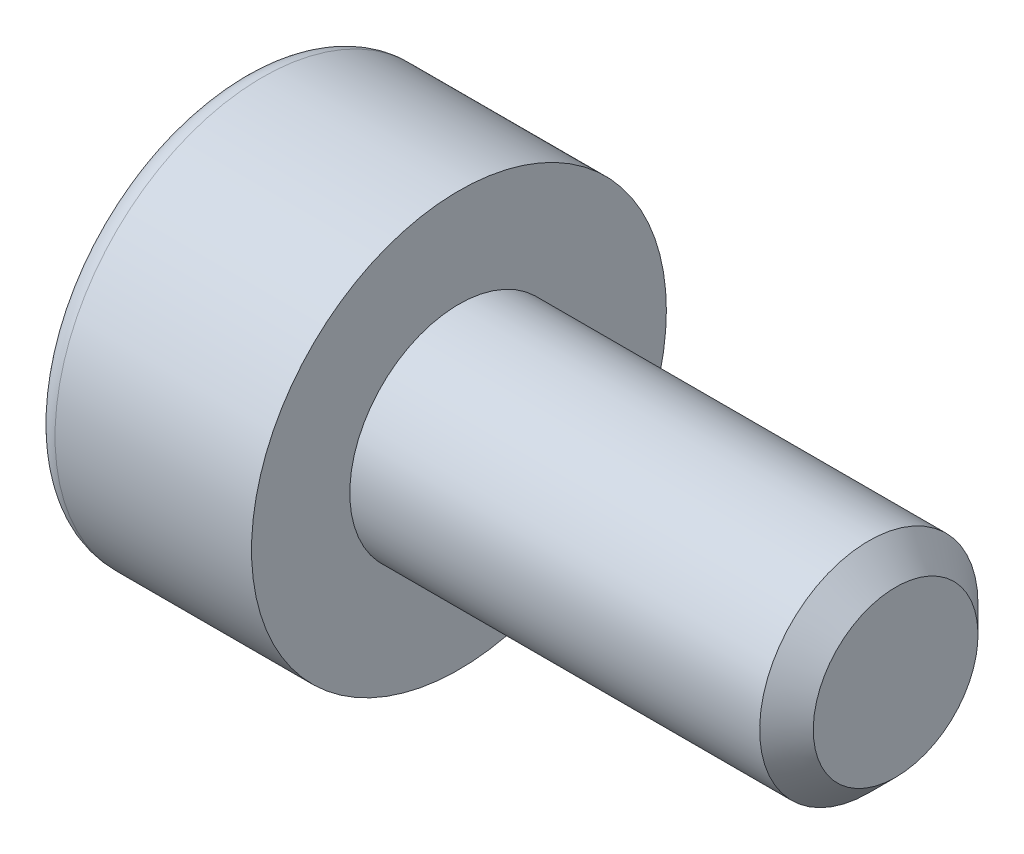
ISO-10303-21;
HEADER;
FILE_DESCRIPTION(('STEP AP214'),'2;1');
FILE_NAME('part.step','',(''),(''),'','','');
FILE_SCHEMA(('AUTOMOTIVE_DESIGN { 1 0 10303 214 1 1 1 1 }'));
ENDSEC;
DATA;
#1=APPLICATION_CONTEXT('core data for automotive mechanical design processes');
#2=APPLICATION_PROTOCOL_DEFINITION('international standard','automotive_design',2000,#1);
#3=PRODUCT_CONTEXT('',#1,'mechanical');
#4=PRODUCT('Part','Part','',(#3));
#5=PRODUCT_RELATED_PRODUCT_CATEGORY('part','',(#4));
#6=PRODUCT_DEFINITION_FORMATION('','',#4);
#7=PRODUCT_DEFINITION_CONTEXT('part definition',#1,'design');
#8=PRODUCT_DEFINITION('design','',#6,#7);
#9=PRODUCT_DEFINITION_SHAPE('','',#8);
#10=(LENGTH_UNIT() NAMED_UNIT(*) SI_UNIT(.MILLI.,.METRE.));
#11=(NAMED_UNIT(*) PLANE_ANGLE_UNIT() SI_UNIT($,.RADIAN.));
#12=(NAMED_UNIT(*) SI_UNIT($,.STERADIAN.) SOLID_ANGLE_UNIT());
#13=UNCERTAINTY_MEASURE_WITH_UNIT(LENGTH_MEASURE(1.E-05),#10,'distance_accuracy_value','');
#14=(GEOMETRIC_REPRESENTATION_CONTEXT(3) GLOBAL_UNCERTAINTY_ASSIGNED_CONTEXT((#13)) GLOBAL_UNIT_ASSIGNED_CONTEXT((#10,
#11,#12)) REPRESENTATION_CONTEXT('',''));
#15=CARTESIAN_POINT('',(0.,0.,0.));
#16=DIRECTION('',(0.,0.,1.));
#17=DIRECTION('',(1.,0.,0.));
#18=AXIS2_PLACEMENT_3D('',#15,#16,#17);
#19=CARTESIAN_POINT('',(-0.549999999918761,0.,0.));
#20=DIRECTION('',(-1.,0.,0.));
#21=DIRECTION('',(0.,0.,1.));
#22=AXIS2_PLACEMENT_3D('',#19,#20,#21);
#23=CONICAL_SURFACE('',#22,0.714285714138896,1.04719755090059);
#24=CARTESIAN_POINT('',(-0.137606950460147,0.,-2.8421709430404E-11));
#25=VERTEX_POINT('',#24);
#26=VERTEX_LOOP('',#25);
#27=FACE_BOUND('',#26,.T.);
#28=CARTESIAN_POINT('',(-0.5499999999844,0.,0.));
#29=DIRECTION('',(-1.,0.,0.));
#30=DIRECTION('',(0.,0.,1.));
#31=AXIS2_PLACEMENT_3D('',#28,#29,#30);
#32=CIRCLE('',#31,0.714285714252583);
#33=CARTESIAN_POINT('',(-0.5499999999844,0.,0.714285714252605));
#34=VERTEX_POINT('',#33);
#35=EDGE_CURVE('E175',#34,#34,#32,.T.);
#36=ORIENTED_EDGE('',*,*,#35,.T.);
#37=EDGE_LOOP('',(#36));
#38=FACE_BOUND('',#37,.T.);
#39=ADVANCED_FACE('F17',(#27,#38),#23,.F.);
#40=CARTESIAN_POINT('',(-0.549999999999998,0.430125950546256,0.745000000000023));
#41=DIRECTION('',(0.,0.,1.));
#42=DIRECTION('',(1.,0.,0.));
#43=AXIS2_PLACEMENT_3D('',#40,#41,#42);
#44=PLANE('',#43);
#45=DIRECTION('',(0.,1.00000000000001,0.));
#46=VECTOR('',#45,1.);
#47=CARTESIAN_POINT('',(-0.550000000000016,0.,0.74500000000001));
#48=LINE('',#47,#46);
#49=CARTESIAN_POINT('',(-0.549999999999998,0.430125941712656,0.745000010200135));
#50=VERTEX_POINT('',#49);
#51=CARTESIAN_POINT('',(-0.549999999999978,-0.430125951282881,0.744999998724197));
#52=VERTEX_POINT('',#51);
#53=EDGE_CURVE('E79',#50,#52,#48,.F.);
#54=ORIENTED_EDGE('',*,*,#53,.T.);
#55=DIRECTION('',(1.,0.,0.));
#56=VECTOR('',#55,1.);
#57=CARTESIAN_POINT('',(-0.549999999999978,-0.430125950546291,0.745000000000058));
#58=LINE('',#57,#56);
#59=CARTESIAN_POINT('',(-1.99525190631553,-0.430125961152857,0.744999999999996));
#60=VERTEX_POINT('',#59);
#61=EDGE_CURVE('E77',#52,#60,#58,.F.);
#62=ORIENTED_EDGE('',*,*,#61,.T.);
#63=CARTESIAN_POINT('',(-1.99525188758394,0.430125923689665,0.744999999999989));
#64=CARTESIAN_POINT('',(-1.98057857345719,0.400751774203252,0.745000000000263));
#65=CARTESIAN_POINT('',(-1.96676197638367,0.370889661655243,0.745000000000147));
#66=CARTESIAN_POINT('',(-1.94143587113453,0.309986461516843,0.744999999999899));
#67=CARTESIAN_POINT('',(-1.92994172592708,0.278939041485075,0.744999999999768));
#68=CARTESIAN_POINT('',(-1.91009392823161,0.2159467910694,0.745000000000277));
#69=CARTESIAN_POINT('',(-1.90172964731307,0.184005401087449,0.745000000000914));
#70=CARTESIAN_POINT('',(-1.88885202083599,0.119422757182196,0.744999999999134));
#71=CARTESIAN_POINT('',(-1.8843267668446,0.086783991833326,0.744999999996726));
#72=CARTESIAN_POINT('',(-1.88130477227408,0.0450212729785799,0.745000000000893));
#73=CARTESIAN_POINT('',(-1.88081631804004,0.0360213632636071,0.745000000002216));
#74=CARTESIAN_POINT('',(-1.88016321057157,0.0180152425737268,0.744999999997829));
#75=CARTESIAN_POINT('',(-1.8799983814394,0.00900903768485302,0.744999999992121));
#76=CARTESIAN_POINT('',(-1.88000811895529,-0.0451932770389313,0.74499999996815));
#77=CARTESIAN_POINT('',(-1.88420483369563,-0.0904578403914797,0.744999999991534));
#78=CARTESIAN_POINT('',(-1.90010453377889,-0.17978862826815,0.745000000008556));
#79=CARTESIAN_POINT('',(-1.91184842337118,-0.223846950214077,0.745000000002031));
#80=CARTESIAN_POINT('',(-1.93586010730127,-0.295054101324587,0.744999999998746));
#81=CARTESIAN_POINT('',(-1.94653452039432,-0.322769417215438,0.744999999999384));
#82=CARTESIAN_POINT('',(-1.96966958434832,-0.377150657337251,0.745000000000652));
#83=CARTESIAN_POINT('',(-1.9821130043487,-0.403823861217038,0.745000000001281));
#84=CARTESIAN_POINT('',(-1.99525191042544,-0.430125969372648,0.745000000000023));
#85=B_SPLINE_CURVE_WITH_KNOTS('',3,(#63,#64,#65,#66,#67,#68,#69,#70,#71,#72,#73,#74,#75,#76,#77,
#78,#79,#80,#81,#82,#83,#84),.UNSPECIFIED.,.F.,.F.,(4,2,2,2,2,2,2,2,2,2,4),(0.,
0.0985733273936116,0.197778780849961,0.296644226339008,0.395201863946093,0.422236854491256,
0.449257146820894,0.584802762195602,0.721089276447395,0.810123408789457,0.898343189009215),.UNSPECIFIED.);
#86=CARTESIAN_POINT('',(-1.99525189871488,0.430125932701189,0.745000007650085));
#87=VERTEX_POINT('',#86);
#88=EDGE_CURVE('E22',#87,#60,#85,.T.);
#89=ORIENTED_EDGE('',*,*,#88,.F.);
#90=DIRECTION('',(1.,0.,0.));
#91=VECTOR('',#90,1.);
#92=CARTESIAN_POINT('',(-0.549999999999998,0.430125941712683,0.745000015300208));
#93=LINE('',#92,#91);
#94=EDGE_CURVE('E74',#87,#50,#93,.T.);
#95=ORIENTED_EDGE('',*,*,#94,.T.);
#96=EDGE_LOOP('',(#54,#62,#89,#95));
#97=FACE_BOUND('',#96,.T.);
#98=ADVANCED_FACE('F72',(#97),#44,.F.);
#99=CARTESIAN_POINT('',(-0.549999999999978,0.,0.));
#100=DIRECTION('',(1.,0.,0.));
#101=DIRECTION('',(0.,0.,-1.));
#102=AXIS2_PLACEMENT_3D('',#99,#100,#101);
#103=PLANE('',#102);
#104=ORIENTED_EDGE('',*,*,#35,.F.);
#105=EDGE_LOOP('',(#104));
#106=FACE_BOUND('',#105,.T.);
#107=DIRECTION('',(0.,0.5,0.866025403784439));
#108=VECTOR('',#107,1.);
#109=CARTESIAN_POINT('',(-0.549999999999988,0.430125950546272,-0.744999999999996));
#110=LINE('',#109,#108);
#111=CARTESIAN_POINT('',(-0.549999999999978,0.860251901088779,-6.46011022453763E-12));
#112=VERTEX_POINT('',#111);
#113=CARTESIAN_POINT('',(-0.549999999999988,0.430125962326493,-0.744999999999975));
#114=VERTEX_POINT('',#113);
#115=EDGE_CURVE('E182',#112,#114,#110,.F.);
#116=ORIENTED_EDGE('',*,*,#115,.T.);
#117=DIRECTION('',(0.,1.00000000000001,0.));
#118=VECTOR('',#117,1.);
#119=CARTESIAN_POINT('',(-0.549999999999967,-0.430125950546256,-0.744999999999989));
#120=LINE('',#119,#118);
#121=CARTESIAN_POINT('',(-0.549999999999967,-0.430125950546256,-0.744999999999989));
#122=VERTEX_POINT('',#121);
#123=EDGE_CURVE('E188',#114,#122,#120,.F.);
#124=ORIENTED_EDGE('',*,*,#123,.T.);
#125=DIRECTION('',(0.,0.500000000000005,-0.866025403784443));
#126=VECTOR('',#125,1.);
#127=CARTESIAN_POINT('',(-0.549999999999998,-0.860251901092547,0.));
#128=LINE('',#127,#126);
#129=CARTESIAN_POINT('',(-0.549999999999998,-0.860251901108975,-2.83661982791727E-11));
#130=VERTEX_POINT('',#129);
#131=EDGE_CURVE('E194',#122,#130,#128,.F.);
#132=ORIENTED_EDGE('',*,*,#131,.T.);
#133=DIRECTION('',(0.,-0.5,-0.866025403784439));
#134=VECTOR('',#133,1.);
#135=CARTESIAN_POINT('',(-0.549999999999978,-0.430125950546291,0.745000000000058));
#136=LINE('',#135,#134);
#137=EDGE_CURVE('E168',#130,#52,#136,.F.);
#138=ORIENTED_EDGE('',*,*,#137,.T.);
#139=ORIENTED_EDGE('',*,*,#53,.F.);
#140=DIRECTION('',(0.,-0.500000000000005,0.866025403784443));
#141=VECTOR('',#140,1.);
#142=CARTESIAN_POINT('',(-0.549999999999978,0.860251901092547,0.));
#143=LINE('',#142,#141);
#144=EDGE_CURVE('E87',#50,#112,#143,.F.);
#145=ORIENTED_EDGE('',*,*,#144,.T.);
#146=EDGE_LOOP('',(#116,#124,#132,#138,#139,#145));
#147=FACE_BOUND('',#146,.T.);
#148=ADVANCED_FACE('F232',(#106,#147),#103,.F.);
#149=CARTESIAN_POINT('',(-0.549999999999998,-0.860251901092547,0.));
#150=DIRECTION('',(0.,-0.866025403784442,-0.499999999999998));
#151=DIRECTION('',(0.,0.500000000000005,-0.866025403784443));
#152=AXIS2_PLACEMENT_3D('',#149,#150,#151);
#153=PLANE('',#152);
#154=ORIENTED_EDGE('',*,*,#131,.F.);
#155=DIRECTION('',(-1.,0.,0.));
#156=VECTOR('',#155,1.);
#157=CARTESIAN_POINT('',(-0.549999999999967,-0.430125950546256,-0.744999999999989));
#158=LINE('',#157,#156);
#159=CARTESIAN_POINT('',(-1.99525189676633,-0.430125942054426,-0.745000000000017));
#160=VERTEX_POINT('',#159);
#161=EDGE_CURVE('E191',#122,#160,#158,.T.);
#162=ORIENTED_EDGE('',*,*,#161,.T.);
#163=CARTESIAN_POINT('',(-1.99525187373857,-0.430125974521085,-0.744999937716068));
#164=CARTESIAN_POINT('',(-1.9804824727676,-0.444909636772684,-0.719393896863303));
#165=CARTESIAN_POINT('',(-1.96658057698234,-0.459940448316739,-0.69335977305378));
#166=CARTESIAN_POINT('',(-1.941126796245,-0.490589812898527,-0.640273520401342));
#167=CARTESIAN_POINT('',(-1.92958906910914,-0.506211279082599,-0.613216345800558));
#168=CARTESIAN_POINT('',(-1.90982500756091,-0.537711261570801,-0.558656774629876));
#169=CARTESIAN_POINT('',(-1.90154900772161,-0.553581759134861,-0.531168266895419));
#170=CARTESIAN_POINT('',(-1.88879772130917,-0.585671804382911,-0.475586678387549));
#171=CARTESIAN_POINT('',(-1.88431292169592,-0.601890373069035,-0.447495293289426));
#172=CARTESIAN_POINT('',(-1.88026776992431,-0.629845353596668,-0.399075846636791));
#173=CARTESIAN_POINT('',(-1.87967004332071,-0.641545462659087,-0.37881066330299));
#174=CARTESIAN_POINT('',(-1.88067744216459,-0.664922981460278,-0.338319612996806));
#175=CARTESIAN_POINT('',(-1.88228305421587,-0.67660038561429,-0.318093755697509));
#176=CARTESIAN_POINT('',(-1.89029877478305,-0.711465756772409,-0.257705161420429));
#177=CARTESIAN_POINT('',(-1.89990867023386,-0.734480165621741,-0.217843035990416));
#178=CARTESIAN_POINT('',(-1.92308946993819,-0.774855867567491,-0.147910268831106));
#179=CARTESIAN_POINT('',(-1.93544104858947,-0.792407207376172,-0.117510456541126));
#180=CARTESIAN_POINT('',(-1.96326253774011,-0.826823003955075,-0.0579005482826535));
#181=CARTESIAN_POINT('',(-1.97872229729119,-0.843689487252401,-0.0286869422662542));
#182=CARTESIAN_POINT('',(-1.99525186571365,-0.860251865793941,-6.11390174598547E-08));
#183=B_SPLINE_CURVE_WITH_KNOTS('',3,(#163,#164,#165,#166,#167,#168,#169,#170,#171,#172,#173,
#174,#175,#176,#177,#178,#179,#180,#181,#182),.UNSPECIFIED.,.F.,.F.,(4,2,2,2,2,2,2,2,2,4),(0.,
0.0992212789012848,0.19902041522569,0.297235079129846,0.395202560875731,0.465324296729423,
0.535461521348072,0.675775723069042,0.78726404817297,0.898394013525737),.UNSPECIFIED.);
#184=CARTESIAN_POINT('',(-1.99525188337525,-0.86025188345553,-3.05907521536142E-08));
#185=VERTEX_POINT('',#184);
#186=EDGE_CURVE('E98',#160,#185,#183,.T.);
#187=ORIENTED_EDGE('',*,*,#186,.T.);
#188=DIRECTION('',(1.,0.,0.));
#189=VECTOR('',#188,1.);
#190=CARTESIAN_POINT('',(-0.549999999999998,-0.860251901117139,-4.25492974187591E-11));
#191=LINE('',#190,#189);
#192=EDGE_CURVE('E171',#185,#130,#191,.T.);
#193=ORIENTED_EDGE('',*,*,#192,.T.);
#194=EDGE_LOOP('',(#154,#162,#187,#193));
#195=FACE_BOUND('',#194,.T.);
#196=ADVANCED_FACE('F223',(#195),#153,.F.);
#197=CARTESIAN_POINT('',(-0.549999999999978,-0.430125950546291,0.745000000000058));
#198=DIRECTION('',(0.,-0.866025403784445,0.500000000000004));
#199=DIRECTION('',(0.,-0.5,-0.866025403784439));
#200=AXIS2_PLACEMENT_3D('',#197,#198,#199);
#201=PLANE('',#200);
#202=ORIENTED_EDGE('',*,*,#137,.F.);
#203=ORIENTED_EDGE('',*,*,#192,.F.);
#204=CARTESIAN_POINT('',(-1.99525190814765,-0.860251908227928,-1.23588639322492E-08));
#205=CARTESIAN_POINT('',(-1.9804825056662,-0.845468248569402,0.0256060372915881));
#206=CARTESIAN_POINT('',(-1.96658060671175,-0.830437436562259,0.0516401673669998));
#207=CARTESIAN_POINT('',(-1.94112681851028,-0.799788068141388,0.104726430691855));
#208=CARTESIAN_POINT('',(-1.92958908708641,-0.784166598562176,0.131783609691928));
#209=CARTESIAN_POINT('',(-1.90982501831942,-0.752666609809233,0.186343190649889));
#210=CARTESIAN_POINT('',(-1.90154901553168,-0.736796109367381,0.21383170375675));
#211=CARTESIAN_POINT('',(-1.88879772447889,-0.704706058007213,0.269413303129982));
#212=CARTESIAN_POINT('',(-1.88431292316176,-0.688487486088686,0.297504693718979));
#213=CARTESIAN_POINT('',(-1.88026777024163,-0.660532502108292,0.345924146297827));
#214=CARTESIAN_POINT('',(-1.87967004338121,-0.648832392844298,0.366189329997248));
#215=CARTESIAN_POINT('',(-1.88067744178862,-0.625454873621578,0.406680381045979));
#216=CARTESIAN_POINT('',(-1.88228305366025,-0.613777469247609,0.426906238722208));
#217=CARTESIAN_POINT('',(-1.89029877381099,-0.57891209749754,0.487294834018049));
#218=CARTESIAN_POINT('',(-1.89990866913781,-0.555897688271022,0.5271569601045));
#219=CARTESIAN_POINT('',(-1.92308946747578,-0.515521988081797,0.597089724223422));
#220=CARTESIAN_POINT('',(-1.93544104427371,-0.497970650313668,0.627489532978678));
#221=CARTESIAN_POINT('',(-1.96326252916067,-0.463554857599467,0.687099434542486));
#222=CARTESIAN_POINT('',(-1.97872228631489,-0.446688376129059,0.716313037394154));
#223=CARTESIAN_POINT('',(-1.99525185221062,-0.430125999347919,0.744999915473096));
#224=B_SPLINE_CURVE_WITH_KNOTS('',3,(#204,#205,#206,#207,#208,#209,#210,#211,#212,#213,#214,
#215,#216,#217,#218,#219,#220,#221,#222,#223),.UNSPECIFIED.,.F.,.F.,(4,2,2,2,2,2,2,2,2,4),(0.,
0.0992212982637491,0.199020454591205,0.297235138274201,0.395202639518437,0.465324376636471,
0.5354616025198,0.67577580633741,0.787264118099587,0.898394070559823),.UNSPECIFIED.);
#225=EDGE_CURVE('E94',#185,#60,#224,.T.);
#226=ORIENTED_EDGE('',*,*,#225,.T.);
#227=ORIENTED_EDGE('',*,*,#61,.F.);
#228=EDGE_LOOP('',(#202,#203,#226,#227));
#229=FACE_BOUND('',#228,.T.);
#230=ADVANCED_FACE('F230',(#229),#201,.F.);
#231=CARTESIAN_POINT('',(-0.549999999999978,0.860251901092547,0.));
#232=DIRECTION('',(0.,0.866025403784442,0.499999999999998));
#233=DIRECTION('',(0.,-0.500000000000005,0.866025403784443));
#234=AXIS2_PLACEMENT_3D('',#231,#232,#233);
#235=PLANE('',#234);
#236=ORIENTED_EDGE('',*,*,#144,.F.);
#237=ORIENTED_EDGE('',*,*,#94,.F.);
#238=CARTESIAN_POINT('',(-1.99525190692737,0.43012594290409,0.745000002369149));
#239=CARTESIAN_POINT('',(-1.98048250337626,0.444909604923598,0.719393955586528));
#240=CARTESIAN_POINT('',(-1.96658060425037,0.459940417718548,0.693359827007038));
#241=CARTESIAN_POINT('',(-1.94112681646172,0.490589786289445,0.640273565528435));
#242=CARTESIAN_POINT('',(-1.92958908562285,0.50621125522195,0.613216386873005));
#243=CARTESIAN_POINT('',(-1.90982501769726,0.537711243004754,0.558656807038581));
#244=CARTESIAN_POINT('',(-1.90154901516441,0.553581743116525,0.53116829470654));
#245=CARTESIAN_POINT('',(-1.88879772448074,0.585671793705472,0.475586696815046));
#246=CARTESIAN_POINT('',(-1.8843129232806,0.601890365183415,0.447495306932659));
#247=CARTESIAN_POINT('',(-1.88026777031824,0.629845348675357,0.39907585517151));
#248=CARTESIAN_POINT('',(-1.87967004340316,0.641545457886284,0.37881067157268));
#249=CARTESIAN_POINT('',(-1.88067744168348,0.664922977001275,0.338319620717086));
#250=CARTESIAN_POINT('',(-1.88228305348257,0.676600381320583,0.3180937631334));
#251=CARTESIAN_POINT('',(-1.89029877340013,0.711465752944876,0.257705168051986));
#252=CARTESIAN_POINT('',(-1.89990866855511,0.734480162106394,0.217843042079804));
#253=CARTESIAN_POINT('',(-1.92308946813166,0.774855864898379,0.147910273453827));
#254=CARTESIAN_POINT('',(-1.93544104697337,0.792407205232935,0.11751046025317));
#255=CARTESIAN_POINT('',(-1.96326253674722,0.826823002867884,0.0579005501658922));
#256=CARTESIAN_POINT('',(-1.97872229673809,0.843689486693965,0.0286869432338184));
#257=CARTESIAN_POINT('',(-1.99525186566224,0.860251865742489,6.1228036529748E-08));
#258=B_SPLINE_CURVE_WITH_KNOTS('',3,(#238,#239,#240,#241,#242,#243,#244,#245,#246,#247,#248,
#249,#250,#251,#252,#253,#254,#255,#256,#257),.UNSPECIFIED.,.F.,.F.,(4,2,2,2,2,2,2,2,2,4),(0.,
0.0992212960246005,0.199020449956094,0.297235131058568,0.395202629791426,0.465324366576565,
0.53546159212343,0.675775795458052,0.78726412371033,0.898394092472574),.UNSPECIFIED.);
#259=CARTESIAN_POINT('',(-1.99525188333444,0.860251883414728,3.06091610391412E-08));
#260=VERTEX_POINT('',#259);
#261=EDGE_CURVE('E84',#87,#260,#258,.T.);
#262=ORIENTED_EDGE('',*,*,#261,.T.);
#263=DIRECTION('',(1.,0.,0.));
#264=VECTOR('',#263,1.);
#265=CARTESIAN_POINT('',(-0.549999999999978,0.860251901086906,-9.67975699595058E-12));
#266=LINE('',#265,#264);
#267=EDGE_CURVE('E179',#260,#112,#266,.T.);
#268=ORIENTED_EDGE('',*,*,#267,.T.);
#269=EDGE_LOOP('',(#236,#237,#262,#268));
#270=FACE_BOUND('',#269,.T.);
#271=ADVANCED_FACE('F82',(#270),#235,.F.);
#272=CARTESIAN_POINT('',(-0.549999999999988,0.430125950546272,-0.744999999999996));
#273=DIRECTION('',(0.,0.866025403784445,-0.500000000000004));
#274=DIRECTION('',(0.,0.5,0.866025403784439));
#275=AXIS2_PLACEMENT_3D('',#272,#273,#274);
#276=PLANE('',#275);
#277=ORIENTED_EDGE('',*,*,#115,.F.);
#278=ORIENTED_EDGE('',*,*,#267,.F.);
#279=CARTESIAN_POINT('',(-1.99525190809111,0.86025190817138,1.22609006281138E-08));
#280=CARTESIAN_POINT('',(-1.98048250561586,0.84546824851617,-0.025606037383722));
#281=CARTESIAN_POINT('',(-1.96658060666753,0.830437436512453,-0.0516401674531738));
#282=CARTESIAN_POINT('',(-1.94112681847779,0.799788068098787,-0.104726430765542));
#283=CARTESIAN_POINT('',(-1.92958908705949,0.784166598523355,-0.131783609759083));
#284=CARTESIAN_POINT('',(-1.90982501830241,0.752666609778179,-0.186343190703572));
#285=CARTESIAN_POINT('',(-1.90154901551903,0.736796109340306,-0.213831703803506));
#286=CARTESIAN_POINT('',(-1.88879772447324,0.704706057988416,-0.269413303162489));
#287=CARTESIAN_POINT('',(-1.88431292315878,0.688487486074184,-0.297504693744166));
#288=CARTESIAN_POINT('',(-1.88026777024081,0.66053250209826,-0.345924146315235));
#289=CARTESIAN_POINT('',(-1.87967004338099,0.648832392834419,-0.366189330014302));
#290=CARTESIAN_POINT('',(-1.88067744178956,0.625454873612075,-0.406680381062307));
#291=CARTESIAN_POINT('',(-1.88228305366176,0.613777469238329,-0.426906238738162));
#292=CARTESIAN_POINT('',(-1.89029877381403,0.57891209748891,-0.48729483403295));
#293=CARTESIAN_POINT('',(-1.89990866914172,0.55589768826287,-0.527156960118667));
#294=CARTESIAN_POINT('',(-1.92308946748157,0.515521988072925,-0.597089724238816));
#295=CARTESIAN_POINT('',(-1.93544104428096,0.497970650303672,-0.627489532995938));
#296=CARTESIAN_POINT('',(-1.96326252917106,0.463554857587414,-0.687099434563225));
#297=CARTESIAN_POINT('',(-1.97872228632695,0.446688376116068,-0.716313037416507));
#298=CARTESIAN_POINT('',(-1.99525185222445,0.430125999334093,-0.744999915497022));
#299=B_SPLINE_CURVE_WITH_KNOTS('',3,(#279,#280,#281,#282,#283,#284,#285,#286,#287,#288,#289,
#290,#291,#292,#293,#294,#295,#296,#297,#298),.UNSPECIFIED.,.F.,.F.,(4,2,2,2,2,2,2,2,2,4),(0.,
0.09922129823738,0.19902045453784,0.297235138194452,0.395202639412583,0.465324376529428,
0.535461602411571,0.675775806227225,0.787264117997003,0.898394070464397),.UNSPECIFIED.);
#300=CARTESIAN_POINT('',(-1.99525188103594,0.430125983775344,-0.744999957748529));
#301=VERTEX_POINT('',#300);
#302=EDGE_CURVE('E93',#260,#301,#299,.T.);
#303=ORIENTED_EDGE('',*,*,#302,.T.);
#304=DIRECTION('',(-1.,0.,0.));
#305=VECTOR('',#304,1.);
#306=CARTESIAN_POINT('',(-0.549999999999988,0.430125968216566,-0.744999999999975));
#307=LINE('',#306,#305);
#308=EDGE_CURVE('E185',#301,#114,#307,.F.);
#309=ORIENTED_EDGE('',*,*,#308,.T.);
#310=EDGE_LOOP('',(#277,#278,#303,#309));
#311=FACE_BOUND('',#310,.T.);
#312=ADVANCED_FACE('F304',(#311),#276,.F.);
#313=CARTESIAN_POINT('',(-0.549999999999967,-0.430125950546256,-0.744999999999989));
#314=DIRECTION('',(0.,0.,-1.));
#315=DIRECTION('',(-1.,0.,0.));
#316=AXIS2_PLACEMENT_3D('',#313,#314,#315);
#317=PLANE('',#316);
#318=ORIENTED_EDGE('',*,*,#123,.F.);
#319=ORIENTED_EDGE('',*,*,#308,.F.);
#320=CARTESIAN_POINT('',(-1.99525192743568,0.430125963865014,-0.744999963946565));
#321=CARTESIAN_POINT('',(-1.98057860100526,0.400751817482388,-0.744999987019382));
#322=CARTESIAN_POINT('',(-1.96676199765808,0.370889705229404,-0.744999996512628));
#323=CARTESIAN_POINT('',(-1.94143588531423,0.309986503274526,-0.745000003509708));
#324=CARTESIAN_POINT('',(-1.92994173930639,0.278939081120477,-0.745000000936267));
#325=CARTESIAN_POINT('',(-1.91009393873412,0.215946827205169,-0.744999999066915));
#326=CARTESIAN_POINT('',(-1.90172965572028,0.184005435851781,-0.744999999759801));
#327=CARTESIAN_POINT('',(-1.88885202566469,0.119422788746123,-0.745000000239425));
#328=CARTESIAN_POINT('',(-1.88432677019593,0.0867840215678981,-0.745000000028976));
#329=CARTESIAN_POINT('',(-1.88130477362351,0.0450212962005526,-0.744999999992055));
#330=CARTESIAN_POINT('',(-1.88081631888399,0.0360213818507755,-0.744999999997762));
#331=CARTESIAN_POINT('',(-1.88016321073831,0.0180152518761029,-0.745000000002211));
#332=CARTESIAN_POINT('',(-1.87999838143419,0.00900904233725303,-0.745000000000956));
#333=CARTESIAN_POINT('',(-1.88000811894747,-0.0451932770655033,-0.744999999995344));
#334=CARTESIAN_POINT('',(-1.88420483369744,-0.0904578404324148,-0.744999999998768));
#335=CARTESIAN_POINT('',(-1.90010453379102,-0.179788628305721,-0.745000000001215));
#336=CARTESIAN_POINT('',(-1.91184842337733,-0.223846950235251,-0.745000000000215));
#337=CARTESIAN_POINT('',(-1.93586010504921,-0.295054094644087,-0.744999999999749));
#338=CARTESIAN_POINT('',(-1.94653451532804,-0.322769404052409,-0.744999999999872));
#339=CARTESIAN_POINT('',(-1.96966957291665,-0.377150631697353,-0.745000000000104));
#340=CARTESIAN_POINT('',(-1.98211298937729,-0.403823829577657,-0.745000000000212));
#341=CARTESIAN_POINT('',(-1.9952518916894,-0.430125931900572,-0.74500000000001));
#342=B_SPLINE_CURVE_WITH_KNOTS('',3,(#320,#321,#322,#323,#324,#325,#326,#327,#328,#329,#330,
#331,#332,#333,#334,#335,#336,#337,#338,#339,#340,#341),.UNSPECIFIED.,.F.,.F.,(4,2,2,2,2,2,2,2,
2,2,4),(0.,0.0985733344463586,0.197778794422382,0.29664424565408,0.395201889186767,
0.422236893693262,0.449257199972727,0.584802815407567,0.721089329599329,0.810123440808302,
0.8983432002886),.UNSPECIFIED.);
#343=EDGE_CURVE('E96',#301,#160,#342,.T.);
#344=ORIENTED_EDGE('',*,*,#343,.T.);
#345=ORIENTED_EDGE('',*,*,#161,.F.);
#346=EDGE_LOOP('',(#318,#319,#344,#345));
#347=FACE_BOUND('',#346,.T.);
#348=ADVANCED_FACE('F120',(#347),#317,.F.);
#349=CARTESIAN_POINT('',(-1.999999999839,0.,0.));
#350=DIRECTION('',(-1.,0.,0.));
#351=DIRECTION('',(0.,0.,1.));
#352=AXIS2_PLACEMENT_3D('',#349,#350,#351);
#353=CONICAL_SURFACE('',#352,0.864999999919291,0.785398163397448);
#354=ORIENTED_EDGE('',*,*,#261,.F.);
#355=ORIENTED_EDGE('',*,*,#88,.T.);
#356=ORIENTED_EDGE('',*,*,#225,.F.);
#357=ORIENTED_EDGE('',*,*,#186,.F.);
#358=ORIENTED_EDGE('',*,*,#343,.F.);
#359=ORIENTED_EDGE('',*,*,#302,.F.);
#360=EDGE_LOOP('',(#354,#355,#356,#357,#358,#359));
#361=FACE_BOUND('',#360,.T.);
#362=CARTESIAN_POINT('',(-1.99999999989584,0.,0.));
#363=DIRECTION('',(-1.,0.,0.));
#364=DIRECTION('',(0.,0.,1.));
#365=AXIS2_PLACEMENT_3D('',#362,#363,#364);
#366=CIRCLE('',#365,0.864999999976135);
#367=CARTESIAN_POINT('',(-1.99999999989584,0.,0.86499999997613));
#368=VERTEX_POINT('',#367);
#369=EDGE_CURVE('E136',#368,#368,#366,.F.);
#370=ORIENTED_EDGE('',*,*,#369,.F.);
#371=EDGE_LOOP('',(#370));
#372=FACE_BOUND('',#371,.T.);
#373=ADVANCED_FACE('F90',(#361,#372),#353,.F.);
#374=CARTESIAN_POINT('',(-2.,1.28250000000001,0.));
#375=DIRECTION('',(-1.,0.,0.));
#376=DIRECTION('',(0.,0.,1.));
#377=AXIS2_PLACEMENT_3D('',#374,#375,#376);
#378=PLANE('',#377);
#379=ORIENTED_EDGE('',*,*,#369,.T.);
#380=EDGE_LOOP('',(#379));
#381=FACE_BOUND('',#380,.T.);
#382=CARTESIAN_POINT('',(-1.99999999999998,1.70000000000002,0.));
#383=CARTESIAN_POINT('',(-1.99999997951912,1.70000245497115,0.0305664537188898));
#384=CARTESIAN_POINT('',(-1.99999999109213,1.69917412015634,0.0611268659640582));
#385=CARTESIAN_POINT('',(-2.00000000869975,1.69589489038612,0.12216007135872));
#386=CARTESIAN_POINT('',(-2.00000001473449,1.69344403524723,0.152632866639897));
#387=CARTESIAN_POINT('',(-1.99999994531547,1.68631037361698,0.219494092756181));
#388=CARTESIAN_POINT('',(-1.99999985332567,1.68127925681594,0.255846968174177));
#389=CARTESIAN_POINT('',(-1.99999981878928,1.67340820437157,0.301183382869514));
#390=CARTESIAN_POINT('',(-1.99999981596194,1.67172918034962,0.310375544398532));
#391=CARTESIAN_POINT('',(-1.99999981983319,1.66513061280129,0.344835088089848));
#392=CARTESIAN_POINT('',(-1.99999985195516,1.65969499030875,0.370004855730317));
#393=CARTESIAN_POINT('',(-1.99999992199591,1.64404231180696,0.435266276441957));
#394=CARTESIAN_POINT('',(-1.99999995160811,1.63292512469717,0.475146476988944));
#395=CARTESIAN_POINT('',(-1.9999999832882,1.614013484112,0.53449232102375));
#396=CARTESIAN_POINT('',(-1.99999999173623,1.60729198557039,0.554307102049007));
#397=CARTESIAN_POINT('',(-1.99999999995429,1.59355423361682,0.592488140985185));
#398=CARTESIAN_POINT('',(-2.00000000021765,1.58658030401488,0.610869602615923));
#399=CARTESIAN_POINT('',(-1.99999999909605,1.56715083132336,0.659552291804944));
#400=CARTESIAN_POINT('',(-1.99999999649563,1.55413951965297,0.68963340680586));
#401=CARTESIAN_POINT('',(-1.99999999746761,1.52642076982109,0.749003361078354));
#402=CARTESIAN_POINT('',(-2.00000000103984,1.51171338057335,0.778292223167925));
#403=CARTESIAN_POINT('',(-1.99999999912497,1.48841868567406,0.821557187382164));
#404=CARTESIAN_POINT('',(-1.99999999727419,1.4804477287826,0.835868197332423));
#405=CARTESIAN_POINT('',(-1.99999998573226,1.46410060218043,0.864257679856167));
#406=CARTESIAN_POINT('',(-1.99999997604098,1.45572442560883,0.87833614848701));
#407=CARTESIAN_POINT('',(-1.99999994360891,1.4368568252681,0.90903901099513));
#408=CARTESIAN_POINT('',(-1.9999999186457,1.42627742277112,0.9256093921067));
#409=CARTESIAN_POINT('',(-1.99999982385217,1.40456316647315,0.958383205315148));
#410=CARTESIAN_POINT('',(-1.99999975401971,1.3934282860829,0.974586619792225));
#411=CARTESIAN_POINT('',(-1.99999959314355,1.36664548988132,1.01210764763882));
#412=CARTESIAN_POINT('',(-1.99999950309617,1.35076618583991,1.03326051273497));
#413=CARTESIAN_POINT('',(-1.99999951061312,1.31390000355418,1.0799474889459));
#414=CARTESIAN_POINT('',(-1.99999966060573,1.29262744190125,1.10525758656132));
#415=CARTESIAN_POINT('',(-1.99999989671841,1.25734405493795,1.1446190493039));
#416=CARTESIAN_POINT('',(-1.99999998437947,1.24383374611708,1.15912281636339));
#417=CARTESIAN_POINT('',(-2.00000000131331,1.22689078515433,1.17677832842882));
#418=CARTESIAN_POINT('',(-2.00000000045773,1.2236579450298,1.18012369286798));
#419=CARTESIAN_POINT('',(-1.99999999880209,1.21296499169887,1.19111797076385));
#420=CARTESIAN_POINT('',(-1.99999999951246,1.20545898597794,1.19872249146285));
#421=CARTESIAN_POINT('',(-2.000000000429,1.1864692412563,1.21760476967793));
#422=CARTESIAN_POINT('',(-2.00000000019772,1.17489591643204,1.22879266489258));
#423=CARTESIAN_POINT('',(-1.99999999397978,1.14749877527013,1.25454690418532));
#424=CARTESIAN_POINT('',(-1.9999999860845,1.13155397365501,1.26898463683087));
#425=CARTESIAN_POINT('',(-1.9999999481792,1.0950506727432,1.30080550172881));
#426=CARTESIAN_POINT('',(-1.99999991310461,1.0743407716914,1.31801567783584));
#427=CARTESIAN_POINT('',(-1.99999983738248,1.0404446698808,1.34484655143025));
#428=CARTESIAN_POINT('',(-1.99999980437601,1.02750918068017,1.354785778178));
#429=CARTESIAN_POINT('',(-1.99999974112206,1.00135360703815,1.37428302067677));
#430=CARTESIAN_POINT('',(-1.99999971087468,0.98813351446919,1.38384102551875));
#431=CARTESIAN_POINT('',(-1.9999996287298,0.948064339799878,1.41193217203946));
#432=CARTESIAN_POINT('',(-1.99999958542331,0.920804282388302,1.42988409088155));
#433=CARTESIAN_POINT('',(-1.99999954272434,0.865287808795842,1.46417098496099));
#434=CARTESIAN_POINT('',(-1.99999954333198,0.837031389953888,1.48050595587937));
#435=CARTESIAN_POINT('',(-1.99999958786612,0.779616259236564,1.51150343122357));
#436=CARTESIAN_POINT('',(-1.99999963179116,0.750457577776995,1.5261659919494));
#437=CARTESIAN_POINT('',(-1.99999974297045,0.691340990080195,1.55377339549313));
#438=CARTESIAN_POINT('',(-1.99999981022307,0.661383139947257,1.56671835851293));
#439=CARTESIAN_POINT('',(-1.99999993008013,0.600760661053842,1.59082700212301));
#440=CARTESIAN_POINT('',(-1.99999998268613,0.570096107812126,1.60199087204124));
#441=CARTESIAN_POINT('',(-2.00000000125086,0.52714423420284,1.61627407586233));
#442=CARTESIAN_POINT('',(-2.00000000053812,0.515098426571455,1.62013437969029));
#443=CARTESIAN_POINT('',(-1.99999999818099,0.48411244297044,1.6296981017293));
#444=CARTESIAN_POINT('',(-1.99999999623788,0.465113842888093,1.63521373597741));
#445=CARTESIAN_POINT('',(-1.99999999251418,0.420053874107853,1.64745065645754));
#446=CARTESIAN_POINT('',(-1.99999999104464,0.393915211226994,1.65388986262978));
#447=CARTESIAN_POINT('',(-1.99999999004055,0.351892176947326,1.66319489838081));
#448=CARTESIAN_POINT('',(-1.99999998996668,0.336094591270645,1.66645886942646));
#449=CARTESIAN_POINT('',(-1.99999999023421,0.302661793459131,1.67287305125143));
#450=CARTESIAN_POINT('',(-1.99999999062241,0.285016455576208,1.67597081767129));
#451=CARTESIAN_POINT('',(-1.9999999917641,0.247876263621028,1.68188882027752));
#452=CARTESIAN_POINT('',(-1.99999999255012,0.228372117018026,1.68465075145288));
#453=CARTESIAN_POINT('',(-1.99999999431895,0.18751024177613,1.68971557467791));
#454=CARTESIAN_POINT('',(-1.99999999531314,0.166144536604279,1.69195428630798));
#455=CARTESIAN_POINT('',(-1.99999999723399,0.121567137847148,1.69577357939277));
#456=CARTESIAN_POINT('',(-1.9999999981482,0.0983494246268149,1.69728410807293));
#457=CARTESIAN_POINT('',(-1.99999999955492,0.0500901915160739,1.69943156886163));
#458=CARTESIAN_POINT('',(-2.00000000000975,0.0250452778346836,1.69999267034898));
#459=CARTESIAN_POINT('',(-1.99999999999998,0.,1.7));
#460=B_SPLINE_CURVE_WITH_KNOTS('',3,(#382,#383,#384,#385,#386,#387,#388,#389,#390,#391,#392,
#393,#394,#395,#396,#397,#398,#399,#400,#401,#402,#403,#404,#405,#406,#407,#408,#409,#410,#411,
#412,#413,#414,#415,#416,#417,#418,#419,#420,#421,#422,#423,#424,#425,#426,#427,#428,#429,#430,
#431,#432,#433,#434,#435,#436,#437,#438,#439,#440,#441,#442,#443,#444,#445,#446,#447,#448,#449,
#450,#451,#452,#453,#454,#455,#456,#457,#458,#459),.UNSPECIFIED.,.F.,.F.,(4,2,2,2,2,2,2,2,2,2,2,
2,2,2,2,2,2,2,2,2,2,2,2,2,2,2,2,2,2,2,2,2,2,2,2,2,2,2,4),(0.,0.0916770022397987,
0.183351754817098,0.29335810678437,0.321390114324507,0.398614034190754,0.522689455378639,
0.585449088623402,0.644418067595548,0.742686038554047,0.840951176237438,0.890088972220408,
0.939227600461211,0.99819489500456,1.05716501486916,1.1364850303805,1.23560005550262,
1.2950528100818,1.30900934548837,1.34106270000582,1.38934690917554,1.45386279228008,
1.53461196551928,1.58354479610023,1.6324790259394,1.73033954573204,1.82820032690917,
1.9260578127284,2.02390844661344,2.12174867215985,2.15969457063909,2.21903217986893,
2.29975894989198,2.34814723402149,2.40188357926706,2.46096801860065,2.52540061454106,
2.59518145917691,2.67031067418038),.UNSPECIFIED.);
#461=CARTESIAN_POINT('',(-1.99999999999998,1.7,0.));
#462=VERTEX_POINT('',#461);
#463=CARTESIAN_POINT('',(-2.00000000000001,0.,1.7));
#464=VERTEX_POINT('',#463);
#465=EDGE_CURVE('E150',#462,#464,#460,.T.);
#466=ORIENTED_EDGE('',*,*,#465,.F.);
#467=CARTESIAN_POINT('',(-1.99999999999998,0.,-1.70000000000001));
#468=CARTESIAN_POINT('',(-1.99999997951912,0.0305664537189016,-1.70000245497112));
#469=CARTESIAN_POINT('',(-1.99999999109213,0.0611268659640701,-1.69917412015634));
#470=CARTESIAN_POINT('',(-2.00000000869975,0.122160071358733,-1.69589489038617));
#471=CARTESIAN_POINT('',(-2.00000001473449,0.152632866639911,-1.69344403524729));
#472=CARTESIAN_POINT('',(-1.99999994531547,0.219494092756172,-1.68631037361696));
#473=CARTESIAN_POINT('',(-1.99999985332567,0.255846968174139,-1.68127925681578));
#474=CARTESIAN_POINT('',(-1.99999981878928,0.301183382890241,-1.673408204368));
#475=CARTESIAN_POINT('',(-1.99999981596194,0.310375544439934,-1.67172918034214));
#476=CARTESIAN_POINT('',(-1.99999981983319,0.34483508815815,-1.66513061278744));
#477=CARTESIAN_POINT('',(-1.99999985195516,0.370004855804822,-1.65969499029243));
#478=CARTESIAN_POINT('',(-1.99999992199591,0.435266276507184,-1.64404231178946));
#479=CARTESIAN_POINT('',(-1.99999995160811,0.475146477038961,-1.63292512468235));
#480=CARTESIAN_POINT('',(-1.9999999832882,0.534492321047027,-1.61401348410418));
#481=CARTESIAN_POINT('',(-1.99999999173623,0.554307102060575,-1.60729198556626));
#482=CARTESIAN_POINT('',(-1.99999999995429,0.592488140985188,-1.59355423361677));
#483=CARTESIAN_POINT('',(-2.00000000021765,0.610869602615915,-1.5865803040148));
#484=CARTESIAN_POINT('',(-1.99999999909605,0.659552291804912,-1.56715083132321));
#485=CARTESIAN_POINT('',(-1.99999999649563,0.689633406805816,-1.55413951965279));
#486=CARTESIAN_POINT('',(-1.99999999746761,0.749003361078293,-1.52642076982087));
#487=CARTESIAN_POINT('',(-2.00000000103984,0.77829222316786,-1.51171338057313));
#488=CARTESIAN_POINT('',(-1.99999999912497,0.821557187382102,-1.48841868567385));
#489=CARTESIAN_POINT('',(-1.99999999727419,0.835868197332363,-1.4804477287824));
#490=CARTESIAN_POINT('',(-1.99999998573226,0.864257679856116,-1.46410060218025));
#491=CARTESIAN_POINT('',(-1.99999997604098,0.878336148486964,-1.45572442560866));
#492=CARTESIAN_POINT('',(-1.99999994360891,0.909039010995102,-1.43685682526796));
#493=CARTESIAN_POINT('',(-1.9999999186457,0.925609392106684,-1.426277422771));
#494=CARTESIAN_POINT('',(-1.99999982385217,0.958383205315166,-1.40456316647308));
#495=CARTESIAN_POINT('',(-1.99999975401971,0.974586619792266,-1.39342828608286));
#496=CARTESIAN_POINT('',(-1.99999959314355,1.01210764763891,-1.36664548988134));
#497=CARTESIAN_POINT('',(-1.99999950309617,1.03326051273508,-1.35076618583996));
#498=CARTESIAN_POINT('',(-1.99999951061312,1.07994748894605,-1.31390000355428));
#499=CARTESIAN_POINT('',(-1.99999966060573,1.1052575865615,-1.29262744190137));
#500=CARTESIAN_POINT('',(-1.99999989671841,1.14461904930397,-1.25734405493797));
#501=CARTESIAN_POINT('',(-1.99999998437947,1.15912281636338,-1.24383374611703));
#502=CARTESIAN_POINT('',(-2.00000000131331,1.17677832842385,-1.22689078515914));
#503=CARTESIAN_POINT('',(-2.00000000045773,1.18012369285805,-1.22365794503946));
#504=CARTESIAN_POINT('',(-1.99999999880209,1.19111797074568,-1.21296499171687));
#505=CARTESIAN_POINT('',(-1.99999999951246,1.19872249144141,-1.20545898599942));
#506=CARTESIAN_POINT('',(-2.000000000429,1.21760476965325,-1.18646924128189));
#507=CARTESIAN_POINT('',(-2.00000000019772,1.2287926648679,-1.17489591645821));
#508=CARTESIAN_POINT('',(-1.99999999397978,1.25454690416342,-1.14749877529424));
#509=CARTESIAN_POINT('',(-1.9999999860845,1.26898463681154,-1.13155397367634));
#510=CARTESIAN_POINT('',(-1.9999999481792,1.30080550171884,-1.09505067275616));
#511=CARTESIAN_POINT('',(-1.99999991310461,1.31801567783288,-1.07434077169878));
#512=CARTESIAN_POINT('',(-1.99999983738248,1.34484655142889,-1.04044466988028));
#513=CARTESIAN_POINT('',(-1.99999980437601,1.35478577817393,-1.02750918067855));
#514=CARTESIAN_POINT('',(-1.99999974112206,1.3742830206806,-1.0013536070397));
#515=CARTESIAN_POINT('',(-1.99999971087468,1.38384102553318,-0.988133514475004));
#516=CARTESIAN_POINT('',(-1.99999962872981,1.41193217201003,-0.948064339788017));
#517=CARTESIAN_POINT('',(-1.99999958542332,1.42988409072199,-0.920804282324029));
#518=CARTESIAN_POINT('',(-1.99999954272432,1.46417098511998,-0.865287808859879));
#519=CARTESIAN_POINT('',(-1.99999954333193,1.48050595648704,-0.837031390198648));
#520=CARTESIAN_POINT('',(-1.99999958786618,1.51150343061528,-0.779616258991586));
#521=CARTESIAN_POINT('',(-1.99999963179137,1.52616598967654,-0.750457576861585));
#522=CARTESIAN_POINT('',(-1.99999974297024,1.55377339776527,-0.691340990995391));
#523=CARTESIAN_POINT('',(-1.99999981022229,1.56671836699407,-0.66138314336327));
#524=CARTESIAN_POINT('',(-1.9999999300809,1.59082699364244,-0.600760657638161));
#525=CARTESIAN_POINT('',(-1.99999998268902,1.60199084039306,-0.570096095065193));
#526=CARTESIAN_POINT('',(-2.00000000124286,1.61626879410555,-0.527160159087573));
#527=CARTESIAN_POINT('',(-2.00000000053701,1.62012417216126,-0.515130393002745));
#528=CARTESIAN_POINT('',(-1.99999999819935,1.62968092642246,-0.484170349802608));
#529=CARTESIAN_POINT('',(-1.99999999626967,1.63519450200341,-0.465181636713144));
#530=CARTESIAN_POINT('',(-1.99999999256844,1.64743006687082,-0.42013520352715));
#531=CARTESIAN_POINT('',(-1.99999999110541,1.65386979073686,-0.394000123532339));
#532=CARTESIAN_POINT('',(-1.9999999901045,1.66317652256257,-0.351980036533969));
#533=CARTESIAN_POINT('',(-1.99999999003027,1.66644149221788,-0.336181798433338));
#534=CARTESIAN_POINT('',(-1.99999999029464,1.67285803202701,-0.302746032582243));
#535=CARTESIAN_POINT('',(-1.99999999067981,1.67595710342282,-0.285098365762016));
#536=CARTESIAN_POINT('',(-1.99999999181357,1.68187790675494,-0.247951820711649));
#537=CARTESIAN_POINT('',(-1.99999999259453,1.68464126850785,-0.228443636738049));
#538=CARTESIAN_POINT('',(-1.99999999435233,1.68970893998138,-0.187571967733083));
#539=CARTESIAN_POINT('',(-1.99999999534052,1.69194899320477,-0.166200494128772));
#540=CARTESIAN_POINT('',(-1.99999999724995,1.69577071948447,-0.121609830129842));
#541=CARTESIAN_POINT('',(-1.99999999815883,1.6972822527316,-0.0983846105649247));
#542=CARTESIAN_POINT('',(-1.99999999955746,1.69943120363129,-0.0501086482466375));
#543=CARTESIAN_POINT('',(-2.00000000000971,1.69999269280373,-0.0250545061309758));
#544=CARTESIAN_POINT('',(-1.99999999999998,1.70000000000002,0.));
#545=B_SPLINE_CURVE_WITH_KNOTS('',3,(#467,#468,#469,#470,#471,#472,#473,#474,#475,#476,#477,
#478,#479,#480,#481,#482,#483,#484,#485,#486,#487,#488,#489,#490,#491,#492,#493,#494,#495,#496,
#497,#498,#499,#500,#501,#502,#503,#504,#505,#506,#507,#508,#509,#510,#511,#512,#513,#514,#515,
#516,#517,#518,#519,#520,#521,#522,#523,#524,#525,#526,#527,#528,#529,#530,#531,#532,#533,#534,
#535,#536,#537,#538,#539,#540,#541,#542,#543,#544),.UNSPECIFIED.,.F.,.F.,(4,2,2,2,2,2,2,2,2,2,2,
2,2,2,2,2,2,2,2,2,2,2,2,2,2,2,2,2,2,2,2,2,2,2,2,2,2,2,4),(0.,0.0916770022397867,
0.183351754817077,0.293358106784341,0.321390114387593,0.39861403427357,0.522689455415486,
0.585449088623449,0.644418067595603,0.742686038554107,0.840951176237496,0.890088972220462,
0.939227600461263,0.998194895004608,1.0571650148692,1.13648503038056,1.23560005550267,
1.29505281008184,1.30900934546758,1.34106269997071,1.38934690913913,1.45386279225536,
1.53461196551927,1.58354479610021,1.63247902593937,1.73033954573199,1.82820032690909,
1.92605781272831,2.02390844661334,2.12174867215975,2.15964424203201,2.2189516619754,
2.29966837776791,2.34805918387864,2.40180308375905,2.46090010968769,2.52535032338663,
2.5951538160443,2.67031070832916),.UNSPECIFIED.);
#546=CARTESIAN_POINT('',(-1.99999999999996,0.,-1.70000000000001));
#547=VERTEX_POINT('',#546);
#548=EDGE_CURVE('E140',#547,#462,#545,.T.);
#549=ORIENTED_EDGE('',*,*,#548,.F.);
#550=CARTESIAN_POINT('',(-1.99999999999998,0.,0.));
#551=DIRECTION('',(-1.,0.,0.));
#552=DIRECTION('',(0.,0.,1.));
#553=AXIS2_PLACEMENT_3D('',#550,#551,#552);
#554=CIRCLE('',#553,1.70000000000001);
#555=EDGE_CURVE('E42',#464,#547,#554,.F.);
#556=ORIENTED_EDGE('',*,*,#555,.F.);
#557=EDGE_LOOP('',(#466,#549,#556));
#558=FACE_BOUND('',#557,.T.);
#559=ADVANCED_FACE('F119',(#381,#558),#378,.T.);
#560=CARTESIAN_POINT('',(-1.79999999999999,0.,0.));
#561=DIRECTION('',(-1.,0.,0.));
#562=DIRECTION('',(0.,0.,1.));
#563=AXIS2_PLACEMENT_3D('',#560,#561,#562);
#564=TOROIDAL_SURFACE('',#563,1.70000000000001,0.199999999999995);
#565=ORIENTED_EDGE('',*,*,#555,.T.);
#566=ORIENTED_EDGE('',*,*,#548,.T.);
#567=ORIENTED_EDGE('',*,*,#465,.T.);
#568=EDGE_LOOP('',(#565,#566,#567));
#569=FACE_BOUND('',#568,.T.);
#570=CARTESIAN_POINT('',(-1.79999999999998,0.,0.));
#571=DIRECTION('',(1.,0.,0.));
#572=DIRECTION('',(0.,0.,-1.));
#573=AXIS2_PLACEMENT_3D('',#570,#571,#572);
#574=CIRCLE('',#573,1.9);
#575=CARTESIAN_POINT('',(-1.79999999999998,0.,-1.90000000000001));
#576=VERTEX_POINT('',#575);
#577=EDGE_CURVE('E145',#576,#576,#574,.T.);
#578=ORIENTED_EDGE('',*,*,#577,.F.);
#579=EDGE_LOOP('',(#578));
#580=FACE_BOUND('',#579,.T.);
#581=ADVANCED_FACE('F19',(#569,#580),#564,.T.);
#582=CARTESIAN_POINT('',(-0.899999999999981,0.,0.));
#583=DIRECTION('',(1.,0.,0.));
#584=DIRECTION('',(0.,0.,-1.));
#585=AXIS2_PLACEMENT_3D('',#582,#583,#584);
#586=CYLINDRICAL_SURFACE('',#585,1.9);
#587=CARTESIAN_POINT('',(0.,0.,0.));
#588=DIRECTION('',(1.,0.,0.));
#589=DIRECTION('',(0.,0.,-1.));
#590=AXIS2_PLACEMENT_3D('',#587,#588,#589);
#591=CIRCLE('',#590,1.9);
#592=CARTESIAN_POINT('',(0.,0.,-1.90000000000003));
#593=VERTEX_POINT('',#592);
#594=EDGE_CURVE('E141',#593,#593,#591,.T.);
#595=ORIENTED_EDGE('',*,*,#594,.F.);
#596=EDGE_LOOP('',(#595));
#597=FACE_BOUND('',#596,.T.);
#598=ORIENTED_EDGE('',*,*,#577,.T.);
#599=EDGE_LOOP('',(#598));
#600=FACE_BOUND('',#599,.T.);
#601=ADVANCED_FACE('F271',(#597,#600),#586,.T.);
#602=CARTESIAN_POINT('',(4.00000000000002,0.377249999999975,0.));
#603=DIRECTION('',(1.,0.,0.));
#604=DIRECTION('',(0.,0.,-1.));
#605=AXIS2_PLACEMENT_3D('',#602,#603,#604);
#606=PLANE('',#605);
#607=CARTESIAN_POINT('',(4.00000000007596,0.,0.));
#608=DIRECTION('',(-1.,0.,0.));
#609=DIRECTION('',(0.,-1.00000000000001,0.));
#610=AXIS2_PLACEMENT_3D('',#607,#608,#609);
#611=CIRCLE('',#610,0.754500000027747);
#612=CARTESIAN_POINT('',(4.00000000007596,-0.75450000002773,0.));
#613=VERTEX_POINT('',#612);
#614=EDGE_CURVE('E144',#613,#613,#611,.T.);
#615=ORIENTED_EDGE('',*,*,#614,.F.);
#616=EDGE_LOOP('',(#615));
#617=FACE_BOUND('',#616,.T.);
#618=ADVANCED_FACE('F268',(#617),#606,.T.);
#619=CARTESIAN_POINT('',(0.,1.6,0.));
#620=DIRECTION('',(1.,0.,0.));
#621=DIRECTION('',(0.,1.00000000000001,0.));
#622=AXIS2_PLACEMENT_3D('',#619,#620,#621);
#623=PLANE('',#622);
#624=ORIENTED_EDGE('',*,*,#594,.T.);
#625=EDGE_LOOP('',(#624));
#626=FACE_BOUND('',#625,.T.);
#627=CARTESIAN_POINT('',(0.,0.,0.));
#628=DIRECTION('',(1.,0.,0.));
#629=DIRECTION('',(0.,0.,-1.));
#630=AXIS2_PLACEMENT_3D('',#627,#628,#629);
#631=CIRCLE('',#630,1.);
#632=CARTESIAN_POINT('',(0.,0.,-1.00000000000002));
#633=VERTEX_POINT('',#632);
#634=EDGE_CURVE('E33',#633,#633,#631,.T.);
#635=ORIENTED_EDGE('',*,*,#634,.F.);
#636=EDGE_LOOP('',(#635));
#637=FACE_BOUND('',#636,.T.);
#638=ADVANCED_FACE('F261',(#626,#637),#623,.T.);
#639=CARTESIAN_POINT('',(3.75450000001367,0.,0.));
#640=DIRECTION('',(-1.,0.,0.));
#641=DIRECTION('',(0.,-1.00000000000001,0.));
#642=AXIS2_PLACEMENT_3D('',#639,#640,#641);
#643=CONICAL_SURFACE('',#642,1.0000000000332,0.785398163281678);
#644=CARTESIAN_POINT('',(3.75450000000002,0.,0.));
#645=DIRECTION('',(1.,0.,0.));
#646=DIRECTION('',(0.,0.,-1.));
#647=AXIS2_PLACEMENT_3D('',#644,#645,#646);
#648=CIRCLE('',#647,1.);
#649=CARTESIAN_POINT('',(3.75450000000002,0.,-1.00000000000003));
#650=VERTEX_POINT('',#649);
#651=EDGE_CURVE('E11',#650,#650,#648,.F.);
#652=ORIENTED_EDGE('',*,*,#651,.F.);
#653=EDGE_LOOP('',(#652));
#654=FACE_BOUND('',#653,.T.);
#655=ORIENTED_EDGE('',*,*,#614,.T.);
#656=EDGE_LOOP('',(#655));
#657=FACE_BOUND('',#656,.T.);
#658=ADVANCED_FACE('F255',(#654,#657),#643,.T.);
#659=CARTESIAN_POINT('',(2.13225000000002,0.,0.));
#660=DIRECTION('',(1.,0.,0.));
#661=DIRECTION('',(0.,0.,-1.));
#662=AXIS2_PLACEMENT_3D('',#659,#660,#661);
#663=CYLINDRICAL_SURFACE('',#662,1.);
#664=ORIENTED_EDGE('',*,*,#634,.T.);
#665=EDGE_LOOP('',(#664));
#666=FACE_BOUND('',#665,.T.);
#667=ORIENTED_EDGE('',*,*,#651,.T.);
#668=EDGE_LOOP('',(#667));
#669=FACE_BOUND('',#668,.T.);
#670=ADVANCED_FACE('F253',(#666,#669),#663,.T.);
#671=CLOSED_SHELL('',(#39,#98,#148,#196,#230,#271,#312,#348,#373,#559,#581,#601,#618,#638,#658,#670));
#672=MANIFOLD_SOLID_BREP('B1',#671);
#673=ADVANCED_BREP_SHAPE_REPRESENTATION('',(#18,#672),#14);
#674=SHAPE_DEFINITION_REPRESENTATION(#9,#673);
ENDSEC;
END-ISO-10303-21;
